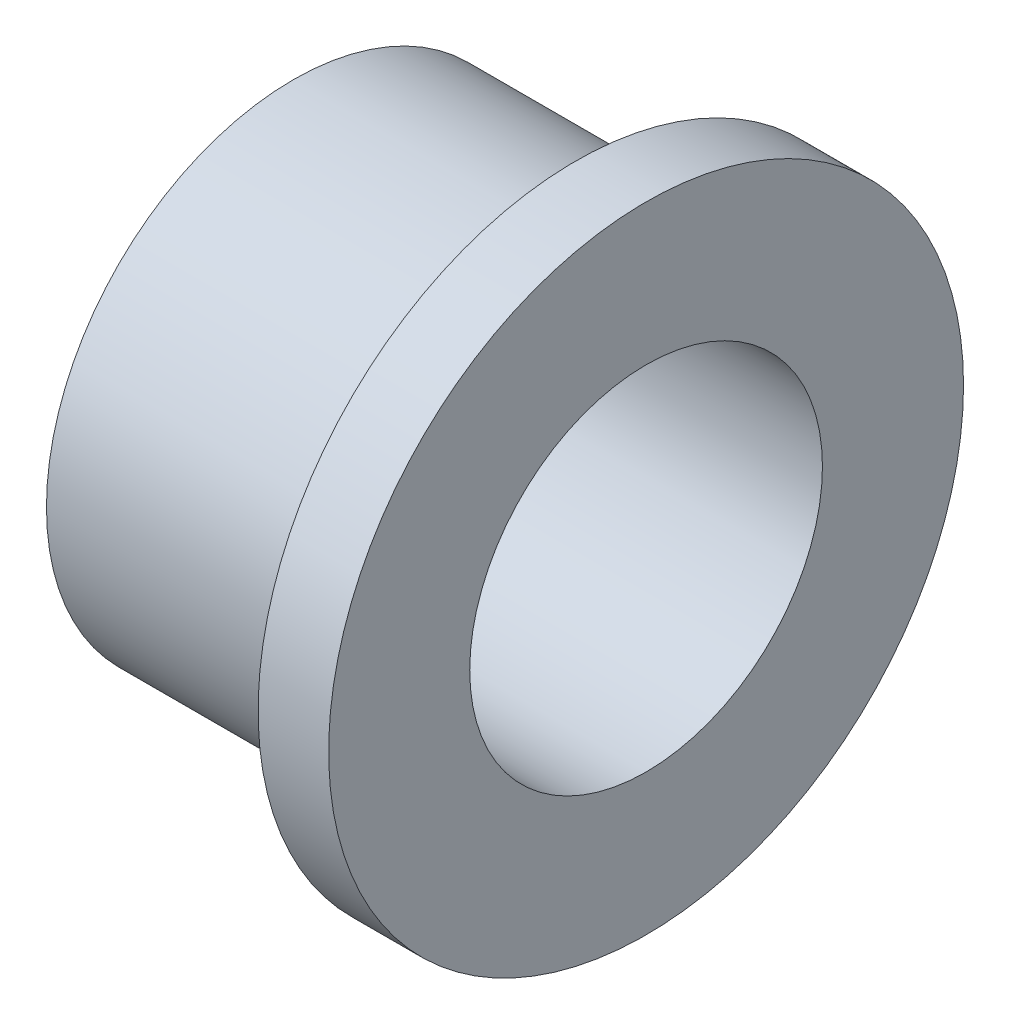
from build123d import *


with BuildPart() as part:
    # Sketch1 → Revolve1 (revolve)
    with BuildSketch(Plane(origin=(0, 0, 0), x_dir=(1, 0, 0), z_dir=(0, 1, 0))):
        Polygon((-15.875, 7.9375), (0, 7.9375), (0, 14.2875), (-3.175, 14.2875), (-3.175, 11.1125), (-15.875, 11.1125), align=None)
    revolve(axis=Axis((0, 0, 0), (-1, 0, 0)))


solid = part.part
